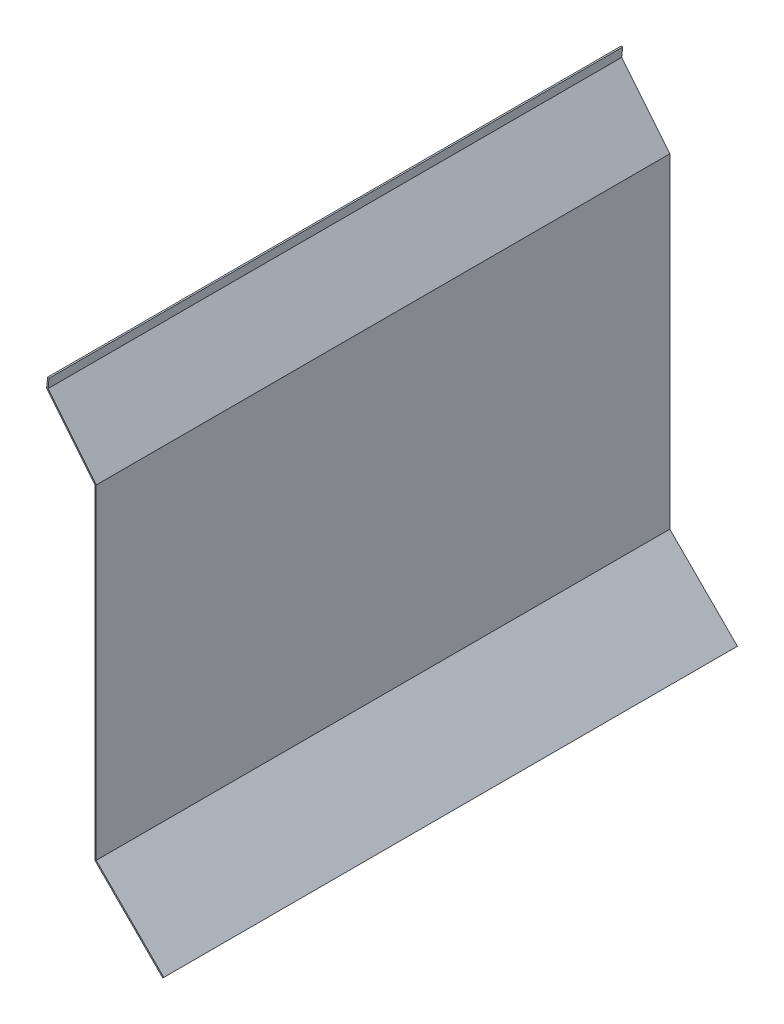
from build123d import *

# Parameters (mm, degrees)
BASE_EXTRUSION_DEPTH = 600


with BuildPart() as part:
    # Esquisse2 → Base-Extrusion (new body)
    with BuildSketch(Plane.XY):
        Polygon((-3670.673102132, 3490.451632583), (-3669.181319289, 3490.294839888), (-3670.226603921, 3480.349620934), (-3619.880972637, 3418.177944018), (-3619.880972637, 3078.177944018), (-3549.170294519, 3007.467265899), (-3550.230954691, 3006.406605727), (-3621.380972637, 3077.556623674), (-3621.380972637, 3417.646766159), (-3671.783332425, 3479.888496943), align=None)
    extrude(amount=BASE_EXTRUSION_DEPTH)


solid = part.part
